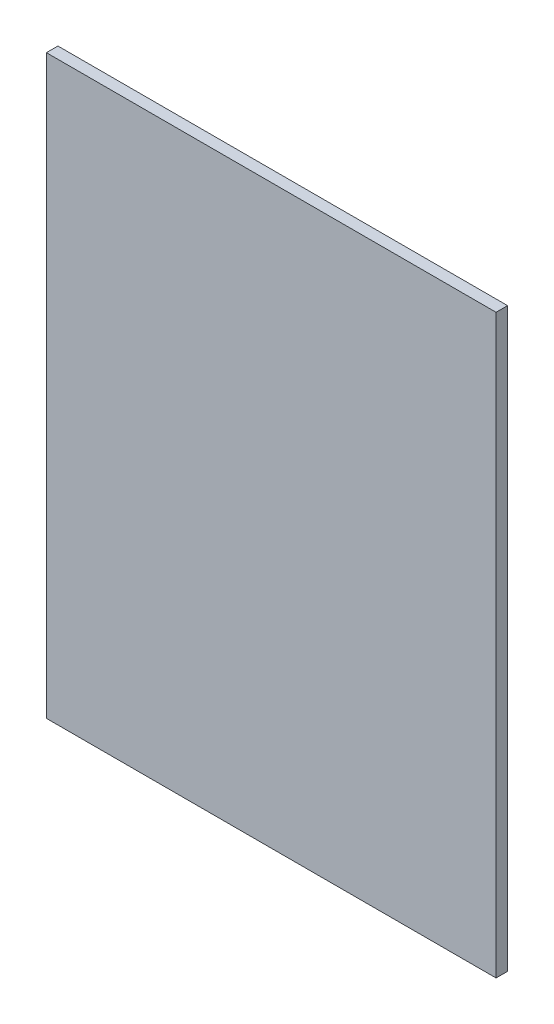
ISO-10303-21;
HEADER;
FILE_DESCRIPTION(('STEP AP214'),'2;1');
FILE_NAME('part.step','',(''),(''),'','','');
FILE_SCHEMA(('AUTOMOTIVE_DESIGN { 1 0 10303 214 1 1 1 1 }'));
ENDSEC;
DATA;
#1=APPLICATION_CONTEXT('core data for automotive mechanical design processes');
#2=APPLICATION_PROTOCOL_DEFINITION('international standard','automotive_design',2000,#1);
#3=PRODUCT_CONTEXT('',#1,'mechanical');
#4=PRODUCT('Part','Part','',(#3));
#5=PRODUCT_RELATED_PRODUCT_CATEGORY('part','',(#4));
#6=PRODUCT_DEFINITION_FORMATION('','',#4);
#7=PRODUCT_DEFINITION_CONTEXT('part definition',#1,'design');
#8=PRODUCT_DEFINITION('design','',#6,#7);
#9=PRODUCT_DEFINITION_SHAPE('','',#8);
#10=(LENGTH_UNIT() NAMED_UNIT(*) SI_UNIT(.MILLI.,.METRE.));
#11=(NAMED_UNIT(*) PLANE_ANGLE_UNIT() SI_UNIT($,.RADIAN.));
#12=(NAMED_UNIT(*) SI_UNIT($,.STERADIAN.) SOLID_ANGLE_UNIT());
#13=UNCERTAINTY_MEASURE_WITH_UNIT(LENGTH_MEASURE(1.E-05),#10,'distance_accuracy_value','');
#14=(GEOMETRIC_REPRESENTATION_CONTEXT(3) GLOBAL_UNCERTAINTY_ASSIGNED_CONTEXT((#13)) GLOBAL_UNIT_ASSIGNED_CONTEXT((#10,
#11,#12)) REPRESENTATION_CONTEXT('',''));
#15=CARTESIAN_POINT('',(0.,0.,0.));
#16=DIRECTION('',(0.,0.,1.));
#17=DIRECTION('',(1.,0.,0.));
#18=AXIS2_PLACEMENT_3D('',#15,#16,#17);
#19=CARTESIAN_POINT('',(0.,0.,-10.));
#20=DIRECTION('',(0.,-1.,0.));
#21=DIRECTION('',(0.,0.,-1.));
#22=AXIS2_PLACEMENT_3D('',#19,#20,#21);
#23=PLANE('',#22);
#24=DIRECTION('',(1.,0.,0.));
#25=VECTOR('',#24,1.);
#26=CARTESIAN_POINT('',(0.,0.,0.));
#27=LINE('',#26,#25);
#28=CARTESIAN_POINT('',(-390.,0.,0.));
#29=VERTEX_POINT('',#28);
#30=CARTESIAN_POINT('',(0.,0.,0.));
#31=VERTEX_POINT('',#30);
#32=EDGE_CURVE('E97',#29,#31,#27,.T.);
#33=ORIENTED_EDGE('',*,*,#32,.F.);
#34=DIRECTION('',(0.,0.,1.));
#35=VECTOR('',#34,1.);
#36=CARTESIAN_POINT('',(-390.,0.,-10.));
#37=LINE('',#36,#35);
#38=CARTESIAN_POINT('',(-390.,0.,-10.));
#39=VERTEX_POINT('',#38);
#40=EDGE_CURVE('E11',#39,#29,#37,.T.);
#41=ORIENTED_EDGE('',*,*,#40,.F.);
#42=DIRECTION('',(1.,0.,0.));
#43=VECTOR('',#42,1.);
#44=CARTESIAN_POINT('',(0.,0.,-10.));
#45=LINE('',#44,#43);
#46=CARTESIAN_POINT('',(0.,0.,-10.));
#47=VERTEX_POINT('',#46);
#48=EDGE_CURVE('E91',#39,#47,#45,.T.);
#49=ORIENTED_EDGE('',*,*,#48,.T.);
#50=DIRECTION('',(0.,0.,1.));
#51=VECTOR('',#50,1.);
#52=CARTESIAN_POINT('',(0.,0.,-10.));
#53=LINE('',#52,#51);
#54=EDGE_CURVE('E36',#47,#31,#53,.T.);
#55=ORIENTED_EDGE('',*,*,#54,.T.);
#56=EDGE_LOOP('',(#33,#41,#49,#55));
#57=FACE_BOUND('',#56,.T.);
#58=ADVANCED_FACE('F33',(#57),#23,.T.);
#59=CARTESIAN_POINT('',(-390.,0.,-10.));
#60=DIRECTION('',(-1.,0.,0.));
#61=DIRECTION('',(0.,0.,1.));
#62=AXIS2_PLACEMENT_3D('',#59,#60,#61);
#63=PLANE('',#62);
#64=DIRECTION('',(0.,-1.,0.));
#65=VECTOR('',#64,1.);
#66=CARTESIAN_POINT('',(-390.,0.,0.));
#67=LINE('',#66,#65);
#68=CARTESIAN_POINT('',(-390.,500.,0.));
#69=VERTEX_POINT('',#68);
#70=EDGE_CURVE('E93',#69,#29,#67,.T.);
#71=ORIENTED_EDGE('',*,*,#70,.F.);
#72=DIRECTION('',(0.,0.,1.));
#73=VECTOR('',#72,1.);
#74=CARTESIAN_POINT('',(-390.,500.,-10.));
#75=LINE('',#74,#73);
#76=CARTESIAN_POINT('',(-390.,500.,-10.));
#77=VERTEX_POINT('',#76);
#78=EDGE_CURVE('E42',#77,#69,#75,.T.);
#79=ORIENTED_EDGE('',*,*,#78,.F.);
#80=DIRECTION('',(0.,-1.,0.));
#81=VECTOR('',#80,1.);
#82=CARTESIAN_POINT('',(-390.,0.,-10.));
#83=LINE('',#82,#81);
#84=EDGE_CURVE('E88',#77,#39,#83,.T.);
#85=ORIENTED_EDGE('',*,*,#84,.T.);
#86=ORIENTED_EDGE('',*,*,#40,.T.);
#87=EDGE_LOOP('',(#71,#79,#85,#86));
#88=FACE_BOUND('',#87,.T.);
#89=ADVANCED_FACE('F107',(#88),#63,.T.);
#90=CARTESIAN_POINT('',(0.,500.,-10.));
#91=DIRECTION('',(0.,1.,0.));
#92=DIRECTION('',(-1.,0.,0.));
#93=AXIS2_PLACEMENT_3D('',#90,#91,#92);
#94=PLANE('',#93);
#95=DIRECTION('',(-1.,0.,0.));
#96=VECTOR('',#95,1.);
#97=CARTESIAN_POINT('',(0.,500.,0.));
#98=LINE('',#97,#96);
#99=CARTESIAN_POINT('',(0.,500.,0.));
#100=VERTEX_POINT('',#99);
#101=EDGE_CURVE('E83',#100,#69,#98,.T.);
#102=ORIENTED_EDGE('',*,*,#101,.F.);
#103=DIRECTION('',(0.,0.,1.));
#104=VECTOR('',#103,1.);
#105=CARTESIAN_POINT('',(0.,500.,-10.));
#106=LINE('',#105,#104);
#107=CARTESIAN_POINT('',(0.,500.,-10.));
#108=VERTEX_POINT('',#107);
#109=EDGE_CURVE('E78',#108,#100,#106,.T.);
#110=ORIENTED_EDGE('',*,*,#109,.F.);
#111=DIRECTION('',(-1.,0.,0.));
#112=VECTOR('',#111,1.);
#113=CARTESIAN_POINT('',(0.,500.,-10.));
#114=LINE('',#113,#112);
#115=EDGE_CURVE('E81',#108,#77,#114,.T.);
#116=ORIENTED_EDGE('',*,*,#115,.T.);
#117=ORIENTED_EDGE('',*,*,#78,.T.);
#118=EDGE_LOOP('',(#102,#110,#116,#117));
#119=FACE_BOUND('',#118,.T.);
#120=ADVANCED_FACE('F80',(#119),#94,.T.);
#121=CARTESIAN_POINT('',(0.,0.,-10.));
#122=DIRECTION('',(1.,0.,0.));
#123=DIRECTION('',(0.,0.,-1.));
#124=AXIS2_PLACEMENT_3D('',#121,#122,#123);
#125=PLANE('',#124);
#126=DIRECTION('',(0.,1.,0.));
#127=VECTOR('',#126,1.);
#128=CARTESIAN_POINT('',(0.,0.,0.));
#129=LINE('',#128,#127);
#130=EDGE_CURVE('E100',#31,#100,#129,.T.);
#131=ORIENTED_EDGE('',*,*,#130,.F.);
#132=ORIENTED_EDGE('',*,*,#54,.F.);
#133=DIRECTION('',(0.,1.,0.));
#134=VECTOR('',#133,1.);
#135=CARTESIAN_POINT('',(0.,0.,-10.));
#136=LINE('',#135,#134);
#137=EDGE_CURVE('E87',#47,#108,#136,.T.);
#138=ORIENTED_EDGE('',*,*,#137,.T.);
#139=ORIENTED_EDGE('',*,*,#109,.T.);
#140=EDGE_LOOP('',(#131,#132,#138,#139));
#141=FACE_BOUND('',#140,.T.);
#142=ADVANCED_FACE('F90',(#141),#125,.T.);
#143=CARTESIAN_POINT('',(0.,0.,-10.));
#144=DIRECTION('',(0.,0.,-1.));
#145=DIRECTION('',(-1.,0.,0.));
#146=AXIS2_PLACEMENT_3D('',#143,#144,#145);
#147=PLANE('',#146);
#148=ORIENTED_EDGE('',*,*,#48,.F.);
#149=ORIENTED_EDGE('',*,*,#84,.F.);
#150=ORIENTED_EDGE('',*,*,#115,.F.);
#151=ORIENTED_EDGE('',*,*,#137,.F.);
#152=EDGE_LOOP('',(#148,#149,#150,#151));
#153=FACE_BOUND('',#152,.T.);
#154=ADVANCED_FACE('F86',(#153),#147,.T.);
#155=CARTESIAN_POINT('',(0.,0.,0.));
#156=DIRECTION('',(0.,0.,-1.));
#157=DIRECTION('',(-1.,0.,0.));
#158=AXIS2_PLACEMENT_3D('',#155,#156,#157);
#159=PLANE('',#158);
#160=ORIENTED_EDGE('',*,*,#32,.T.);
#161=ORIENTED_EDGE('',*,*,#130,.T.);
#162=ORIENTED_EDGE('',*,*,#101,.T.);
#163=ORIENTED_EDGE('',*,*,#70,.T.);
#164=EDGE_LOOP('',(#160,#161,#162,#163));
#165=FACE_BOUND('',#164,.T.);
#166=ADVANCED_FACE('F106',(#165),#159,.F.);
#167=CLOSED_SHELL('',(#58,#89,#120,#142,#154,#166));
#168=MANIFOLD_SOLID_BREP('B2',#167);
#169=ADVANCED_BREP_SHAPE_REPRESENTATION('',(#18,#168),#14);
#170=SHAPE_DEFINITION_REPRESENTATION(#9,#169);
ENDSEC;
END-ISO-10303-21;
